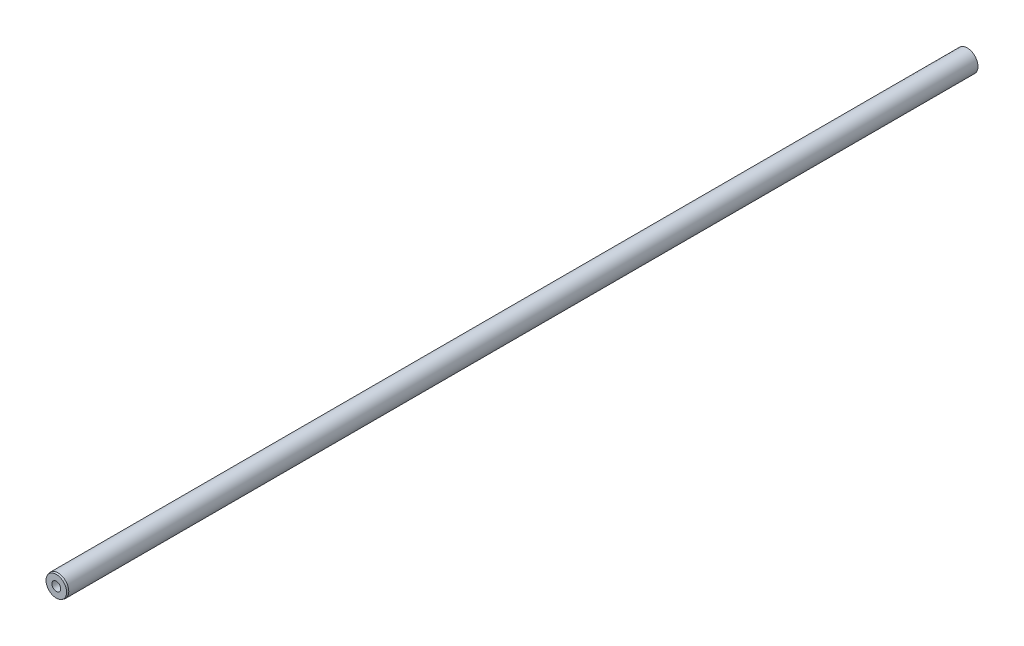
ISO-10303-21;
HEADER;
FILE_DESCRIPTION(('STEP AP214'),'2;1');
FILE_NAME('part.step','',(''),(''),'','','');
FILE_SCHEMA(('AUTOMOTIVE_DESIGN { 1 0 10303 214 1 1 1 1 }'));
ENDSEC;
DATA;
#1=APPLICATION_CONTEXT('core data for automotive mechanical design processes');
#2=APPLICATION_PROTOCOL_DEFINITION('international standard','automotive_design',2000,#1);
#3=PRODUCT_CONTEXT('',#1,'mechanical');
#4=PRODUCT('Part','Part','',(#3));
#5=PRODUCT_RELATED_PRODUCT_CATEGORY('part','',(#4));
#6=PRODUCT_DEFINITION_FORMATION('','',#4);
#7=PRODUCT_DEFINITION_CONTEXT('part definition',#1,'design');
#8=PRODUCT_DEFINITION('design','',#6,#7);
#9=PRODUCT_DEFINITION_SHAPE('','',#8);
#10=(LENGTH_UNIT() NAMED_UNIT(*) SI_UNIT(.MILLI.,.METRE.));
#11=(NAMED_UNIT(*) PLANE_ANGLE_UNIT() SI_UNIT($,.RADIAN.));
#12=(NAMED_UNIT(*) SI_UNIT($,.STERADIAN.) SOLID_ANGLE_UNIT());
#13=UNCERTAINTY_MEASURE_WITH_UNIT(LENGTH_MEASURE(1.E-05),#10,'distance_accuracy_value','');
#14=(GEOMETRIC_REPRESENTATION_CONTEXT(3) GLOBAL_UNCERTAINTY_ASSIGNED_CONTEXT((#13)) GLOBAL_UNIT_ASSIGNED_CONTEXT((#10,
#11,#12)) REPRESENTATION_CONTEXT('',''));
#15=CARTESIAN_POINT('',(0.,0.,0.));
#16=DIRECTION('',(0.,0.,1.));
#17=DIRECTION('',(1.,0.,0.));
#18=AXIS2_PLACEMENT_3D('',#15,#16,#17);
#19=CARTESIAN_POINT('',(0.,0.,671.4744));
#20=DIRECTION('',(0.,0.,-1.));
#21=DIRECTION('',(-1.,0.,0.));
#22=AXIS2_PLACEMENT_3D('',#19,#20,#21);
#23=CYLINDRICAL_SURFACE('',#22,7.9375);
#24=CARTESIAN_POINT('',(0.,0.,670.2044));
#25=DIRECTION('',(0.,0.,1.));
#26=DIRECTION('',(1.,0.,0.));
#27=AXIS2_PLACEMENT_3D('',#24,#25,#26);
#28=CIRCLE('',#27,7.9375);
#29=CARTESIAN_POINT('',(7.9375,0.,670.2044));
#30=VERTEX_POINT('',#29);
#31=EDGE_CURVE('E11',#30,#30,#28,.F.);
#32=ORIENTED_EDGE('',*,*,#31,.T.);
#33=EDGE_LOOP('',(#32));
#34=FACE_BOUND('',#33,.T.);
#35=CARTESIAN_POINT('',(0.,0.,0.));
#36=DIRECTION('',(0.,0.,1.));
#37=DIRECTION('',(1.,0.,0.));
#38=AXIS2_PLACEMENT_3D('',#35,#36,#37);
#39=CIRCLE('',#38,7.9375);
#40=CARTESIAN_POINT('',(7.9375,0.,0.));
#41=VERTEX_POINT('',#40);
#42=EDGE_CURVE('E67',#41,#41,#39,.T.);
#43=ORIENTED_EDGE('',*,*,#42,.T.);
#44=EDGE_LOOP('',(#43));
#45=FACE_BOUND('',#44,.T.);
#46=ADVANCED_FACE('F45',(#34,#45),#23,.T.);
#47=CARTESIAN_POINT('',(0.,0.,671.4744));
#48=DIRECTION('',(0.,0.,1.));
#49=DIRECTION('',(1.,0.,0.));
#50=AXIS2_PLACEMENT_3D('',#47,#48,#49);
#51=PLANE('',#50);
#52=CARTESIAN_POINT('',(0.,0.,671.4744));
#53=DIRECTION('',(0.,0.,1.));
#54=DIRECTION('',(1.,0.,0.));
#55=AXIS2_PLACEMENT_3D('',#52,#53,#54);
#56=CIRCLE('',#55,3.263897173);
#57=CARTESIAN_POINT('',(3.263897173,0.,671.4744));
#58=VERTEX_POINT('',#57);
#59=EDGE_CURVE('E64',#58,#58,#56,.T.);
#60=ORIENTED_EDGE('',*,*,#59,.F.);
#61=EDGE_LOOP('',(#60));
#62=FACE_BOUND('',#61,.T.);
#63=CARTESIAN_POINT('',(0.,0.,671.4744));
#64=DIRECTION('',(0.,0.,1.));
#65=DIRECTION('',(1.,0.,0.));
#66=AXIS2_PLACEMENT_3D('',#63,#64,#65);
#67=CIRCLE('',#66,7.59720452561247);
#68=CARTESIAN_POINT('',(7.59720452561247,0.,671.4744));
#69=VERTEX_POINT('',#68);
#70=EDGE_CURVE('E52',#69,#69,#67,.T.);
#71=ORIENTED_EDGE('',*,*,#70,.T.);
#72=EDGE_LOOP('',(#71));
#73=FACE_BOUND('',#72,.T.);
#74=ADVANCED_FACE('F74',(#62,#73),#51,.T.);
#75=CARTESIAN_POINT('',(0.,0.,0.));
#76=DIRECTION('',(0.,0.,1.));
#77=DIRECTION('',(1.,0.,0.));
#78=AXIS2_PLACEMENT_3D('',#75,#76,#77);
#79=PLANE('',#78);
#80=ORIENTED_EDGE('',*,*,#42,.F.);
#81=EDGE_LOOP('',(#80));
#82=FACE_BOUND('',#81,.T.);
#83=ADVANCED_FACE('F77',(#82),#79,.F.);
#84=CARTESIAN_POINT('',(0.,0.,671.4744));
#85=DIRECTION('',(0.,0.,-1.));
#86=DIRECTION('',(-1.,0.,0.));
#87=AXIS2_PLACEMENT_3D('',#84,#85,#86);
#88=CONICAL_SURFACE('',#87,7.59720452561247,0.26179938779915);
#89=ORIENTED_EDGE('',*,*,#31,.F.);
#90=EDGE_LOOP('',(#89));
#91=FACE_BOUND('',#90,.T.);
#92=ORIENTED_EDGE('',*,*,#70,.F.);
#93=EDGE_LOOP('',(#92));
#94=FACE_BOUND('',#93,.T.);
#95=ADVANCED_FACE('F47',(#91,#94),#88,.T.);
#96=CARTESIAN_POINT('',(0.,0.,671.4744));
#97=DIRECTION('',(0.,0.,1.));
#98=DIRECTION('',(1.,0.,0.));
#99=AXIS2_PLACEMENT_3D('',#96,#97,#98);
#100=CYLINDRICAL_SURFACE('',#99,3.26389717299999);
#101=CARTESIAN_POINT('',(0.,0.,655.59941375));
#102=DIRECTION('',(0.,0.,1.));
#103=DIRECTION('',(1.,0.,0.));
#104=AXIS2_PLACEMENT_3D('',#101,#102,#103);
#105=CIRCLE('',#104,3.26389717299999);
#106=CARTESIAN_POINT('',(3.26389717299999,0.,655.59941375));
#107=VERTEX_POINT('',#106);
#108=EDGE_CURVE('E62',#107,#107,#105,.T.);
#109=ORIENTED_EDGE('',*,*,#108,.F.);
#110=EDGE_LOOP('',(#109));
#111=FACE_BOUND('',#110,.T.);
#112=ORIENTED_EDGE('',*,*,#59,.T.);
#113=EDGE_LOOP('',(#112));
#114=FACE_BOUND('',#113,.T.);
#115=ADVANCED_FACE('F58',(#111,#114),#100,.F.);
#116=CARTESIAN_POINT('',(0.,0.,655.59941375));
#117=DIRECTION('',(0.,0.,1.));
#118=DIRECTION('',(1.,0.,0.));
#119=AXIS2_PLACEMENT_3D('',#116,#117,#118);
#120=CONICAL_SURFACE('',#119,3.26389717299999,1.02974425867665);
#121=CARTESIAN_POINT('',(0.,0.,653.638266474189));
#122=VERTEX_POINT('',#121);
#123=VERTEX_LOOP('',#122);
#124=FACE_BOUND('',#123,.T.);
#125=ORIENTED_EDGE('',*,*,#108,.T.);
#126=EDGE_LOOP('',(#125));
#127=FACE_BOUND('',#126,.T.);
#128=ADVANCED_FACE('F55',(#124,#127),#120,.F.);
#129=CLOSED_SHELL('',(#46,#74,#83,#95,#115,#128));
#130=MANIFOLD_SOLID_BREP('B2',#129);
#131=ADVANCED_BREP_SHAPE_REPRESENTATION('',(#18,#130),#14);
#132=SHAPE_DEFINITION_REPRESENTATION(#9,#131);
ENDSEC;
END-ISO-10303-21;
